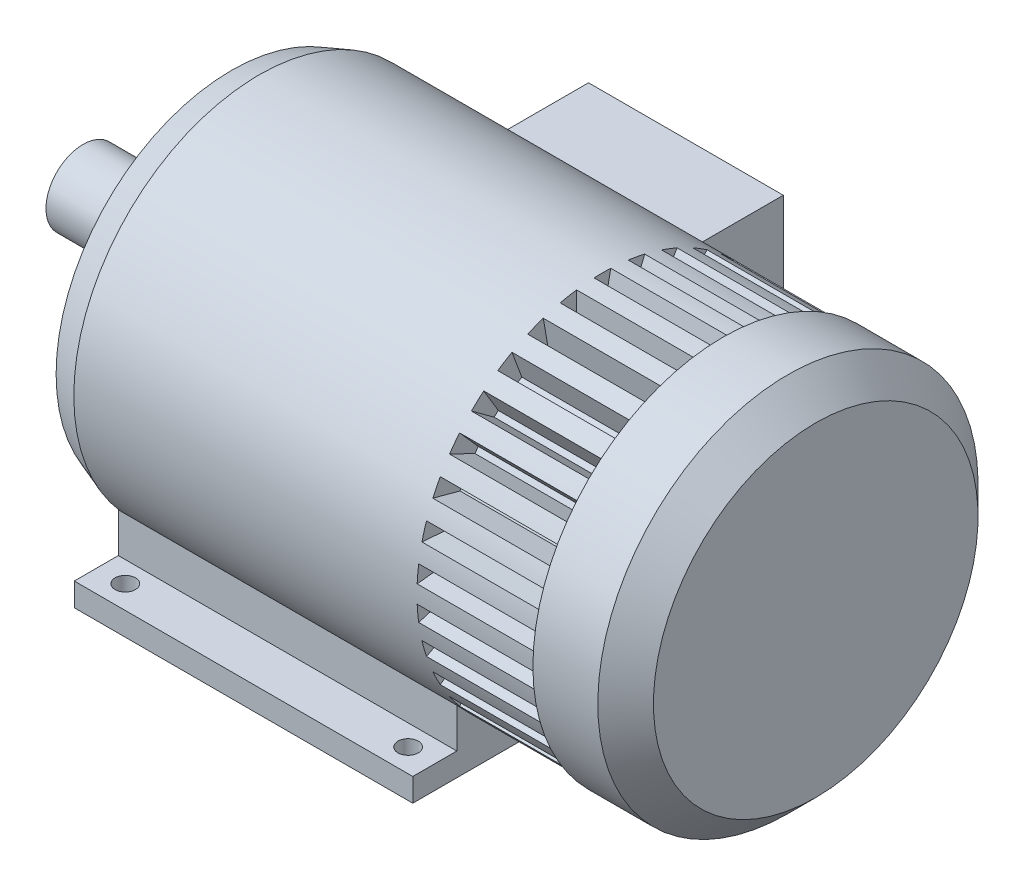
from build123d import *

# Parameters (mm, degrees)
SKETCH5_W           = 365
SKETCH5_H           = 25
BOSS_EXTRUDE1_DEPTH = 197.5
SKETCH6_W           = 300
SKETCH6_H           = 42.712434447
BOSS_EXTRUDE2_DEPTH = 365
CUT_EXTRUDE3_DEPTH  = 130
CIRPATTERN1_COUNT   = 34
SKETCH8_R           = 205
BOSS_EXTRUDE3_DEPTH = 100
CHAMFER1_SIZE       = 30
SKETCH9_R           = 11
CUT_EXTRUDE4_DEPTH  = 814.956387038
SKETCH11_W          = 210
SKETCH11_H          = 160
BOSS_EXTRUDE4_DEPTH = 290


with BuildPart() as part:
    # Sketch1 → Revolve1 (revolve)
    with BuildSketch(Plane.XY):
        Polygon((-690, 0), (-690, 40), (-540, 40), (-540, 80), (-530, 80), (-530, 189.080892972), (-500, 200), (0, 200), (0, 0), align=None)
    revolve(axis=Axis((0, 0, 0), (-1, 0, 0)))

    # Sketch5 → Boss-Extrude1 (add, symmetric)
    with BuildSketch(Plane.XY):
        with Locations((-319.5, -187.5)):
            Rectangle(SKETCH5_W, SKETCH5_H)
    extrude(amount=BOSS_EXTRUDE1_DEPTH, both=True)

    # Sketch6 → Boss-Extrude2 (add)
    with BuildSketch(Plane.ZY.offset(502)):
        with Locations((0, -153.643782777)):
            Rectangle(SKETCH6_W, SKETCH6_H)
    extrude(amount=-BOSS_EXTRUDE2_DEPTH)

    # Sketch7 → Cut-Extrude3 (cut)
    with BuildSketch(Plane(origin=(0, 0, 0), x_dir=(0, 0, -1), z_dir=(1, 0, 0))):
        with BuildLine():
            Line((-3, 170), (3, 170))
            Line((3, 170), (9, 199.79739738))
            ThreePointArc((9, 199.79739738), (0, 200), (-9, 199.79739738))
            Line((-9, 199.79739738), (-3, 170))
        make_face()
    cut_extrude3 = extrude(amount=-CUT_EXTRUDE3_DEPTH, mode=Mode.SUBTRACT)

    # CirPattern1: Cut-Extrude3 ×34 about axis
    cirpattern1_axis = Axis((0, 0, 0), (1, 0, 0))
    for i in range(1, CIRPATTERN1_COUNT):
        add(cut_extrude3.rotate(cirpattern1_axis, i * 360 / CIRPATTERN1_COUNT), mode=Mode.SUBTRACT)

    # Sketch8 → Boss-Extrude3 (add)
    with BuildSketch(Plane(origin=(0, 0, 0), x_dir=(0, 0, -1), z_dir=(1, 0, 0))):
        with Locations(Location((0, 0, 0), (0, 0, 90))):
            Circle(SKETCH8_R)
    extrude(amount=BOSS_EXTRUDE3_DEPTH)

    # Chamfer1
    chamfer1_edges = [part.edges().sort_by_distance(p)[0] for p in [
        (100, -205, 0),
    ]]
    chamfer(chamfer1_edges, length=CHAMFER1_SIZE)

    # Sketch9 → Cut-Extrude4 (cut, through all)
    with BuildSketch(Plane(origin=(0, -175, 0), x_dir=(1, 0, 0), z_dir=(0, 1, 0))):
        with Locations(Location((-472, -172.5, 0), (0, 0, 270))):
            Circle(SKETCH9_R)
        with Locations(Location((-167, -172.5, 0), (0, 0, 270))):
            Circle(SKETCH9_R)
    cut_extrude4 = extrude(amount=-CUT_EXTRUDE4_DEPTH, mode=Mode.SUBTRACT)

    # Mirror1: Cut-Extrude4 across plane
    add(cut_extrude4.mirror(Plane.XY), mode=Mode.SUBTRACT)

    # Sketch11 → Boss-Extrude4 (add)
    with BuildSketch(Plane.XY):
        with Locations((-330, 0)):
            Rectangle(SKETCH11_W, SKETCH11_H)
    extrude(amount=-BOSS_EXTRUDE4_DEPTH)


solid = part.part
